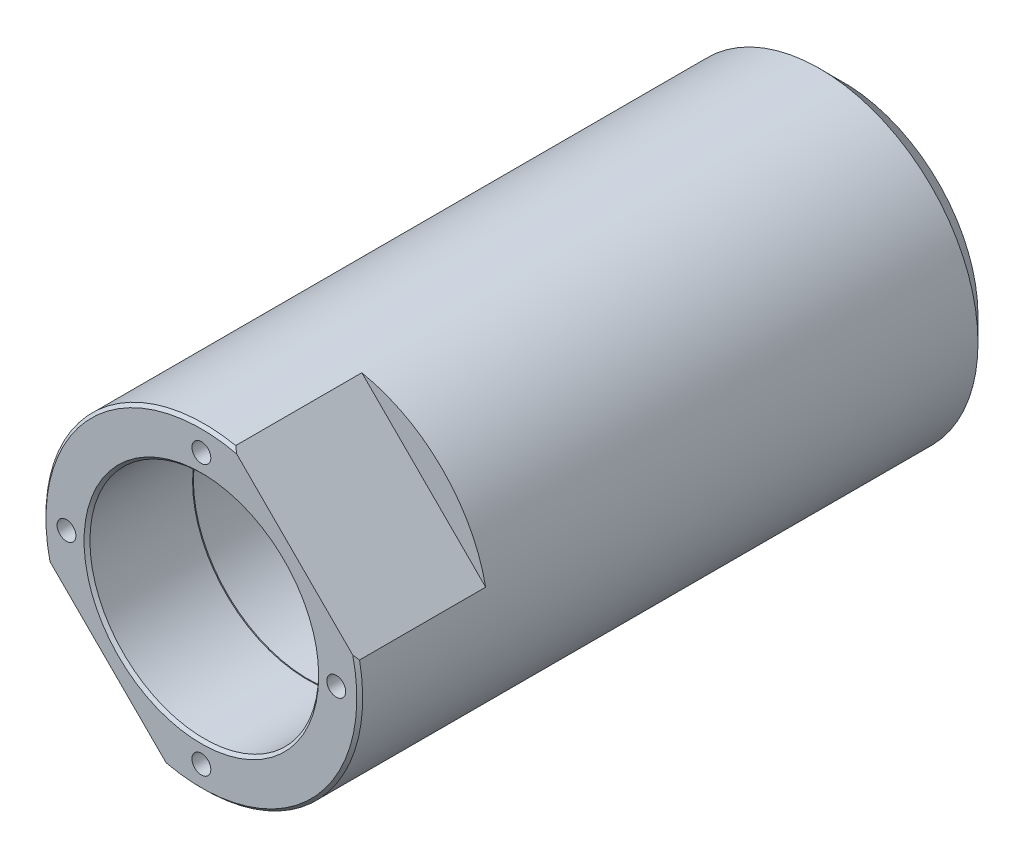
ISO-10303-21;
HEADER;
FILE_DESCRIPTION(('STEP AP214'),'2;1');
FILE_NAME('part.step','',(''),(''),'','','');
FILE_SCHEMA(('AUTOMOTIVE_DESIGN { 1 0 10303 214 1 1 1 1 }'));
ENDSEC;
DATA;
#1=APPLICATION_CONTEXT('core data for automotive mechanical design processes');
#2=APPLICATION_PROTOCOL_DEFINITION('international standard','automotive_design',2000,#1);
#3=PRODUCT_CONTEXT('',#1,'mechanical');
#4=PRODUCT('Part','Part','',(#3));
#5=PRODUCT_RELATED_PRODUCT_CATEGORY('part','',(#4));
#6=PRODUCT_DEFINITION_FORMATION('','',#4);
#7=PRODUCT_DEFINITION_CONTEXT('part definition',#1,'design');
#8=PRODUCT_DEFINITION('design','',#6,#7);
#9=PRODUCT_DEFINITION_SHAPE('','',#8);
#10=(LENGTH_UNIT() NAMED_UNIT(*) SI_UNIT(.MILLI.,.METRE.));
#11=(NAMED_UNIT(*) PLANE_ANGLE_UNIT() SI_UNIT($,.RADIAN.));
#12=(NAMED_UNIT(*) SI_UNIT($,.STERADIAN.) SOLID_ANGLE_UNIT());
#13=UNCERTAINTY_MEASURE_WITH_UNIT(LENGTH_MEASURE(1.E-05),#10,'distance_accuracy_value','');
#14=(GEOMETRIC_REPRESENTATION_CONTEXT(3) GLOBAL_UNCERTAINTY_ASSIGNED_CONTEXT((#13)) GLOBAL_UNIT_ASSIGNED_CONTEXT((#10,
#11,#12)) REPRESENTATION_CONTEXT('',''));
#15=CARTESIAN_POINT('',(0.,0.,0.));
#16=DIRECTION('',(0.,0.,1.));
#17=DIRECTION('',(1.,0.,0.));
#18=AXIS2_PLACEMENT_3D('',#15,#16,#17);
#19=CARTESIAN_POINT('',(0.,0.,0.));
#20=DIRECTION('',(0.,0.,-1.));
#21=DIRECTION('',(-1.,0.,0.));
#22=AXIS2_PLACEMENT_3D('',#19,#20,#21);
#23=CYLINDRICAL_SURFACE('',#22,42.8625);
#24=CARTESIAN_POINT('',(0.,0.,-167.3225));
#25=DIRECTION('',(0.,0.,-1.));
#26=DIRECTION('',(-1.,0.,0.));
#27=AXIS2_PLACEMENT_3D('',#24,#25,#26);
#28=CIRCLE('',#27,42.8625);
#29=CARTESIAN_POINT('',(42.8625,0.,-167.3225));
#30=VERTEX_POINT('',#29);
#31=EDGE_CURVE('E363',#30,#30,#28,.F.);
#32=ORIENTED_EDGE('',*,*,#31,.T.);
#33=EDGE_LOOP('',(#32));
#34=FACE_BOUND('',#33,.T.);
#35=CARTESIAN_POINT('',(0.,0.,-0.793750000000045));
#36=DIRECTION('',(0.,0.,1.));
#37=DIRECTION('',(1.,0.,0.));
#38=AXIS2_PLACEMENT_3D('',#35,#36,#37);
#39=CIRCLE('',#38,42.8625);
#40=CARTESIAN_POINT('',(-42.0105491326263,-8.50339154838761,-0.793750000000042));
#41=VERTEX_POINT('',#40);
#42=CARTESIAN_POINT('',(8.50339154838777,42.0105491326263,-0.793750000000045));
#43=VERTEX_POINT('',#42);
#44=EDGE_CURVE('E56',#41,#43,#39,.F.);
#45=ORIENTED_EDGE('',*,*,#44,.T.);
#46=DIRECTION('',(0.,0.,-1.));
#47=VECTOR('',#46,1.);
#48=CARTESIAN_POINT('',(8.50339154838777,42.0105491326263,0.));
#49=LINE('',#48,#47);
#50=CARTESIAN_POINT('',(8.50339154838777,42.0105491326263,-34.925));
#51=VERTEX_POINT('',#50);
#52=EDGE_CURVE('E338',#43,#51,#49,.T.);
#53=ORIENTED_EDGE('',*,*,#52,.T.);
#54=CARTESIAN_POINT('',(0.,0.,-34.925));
#55=DIRECTION('',(0.,0.,1.));
#56=DIRECTION('',(1.,0.,0.));
#57=AXIS2_PLACEMENT_3D('',#54,#55,#56);
#58=CIRCLE('',#57,42.8625);
#59=CARTESIAN_POINT('',(42.0105491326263,8.50339154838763,-34.925));
#60=VERTEX_POINT('',#59);
#61=EDGE_CURVE('E360',#51,#60,#58,.F.);
#62=ORIENTED_EDGE('',*,*,#61,.T.);
#63=DIRECTION('',(0.,0.,-1.));
#64=VECTOR('',#63,1.);
#65=CARTESIAN_POINT('',(42.0105491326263,8.50339154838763,0.));
#66=LINE('',#65,#64);
#67=CARTESIAN_POINT('',(42.0105491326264,8.50339154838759,-0.793750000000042));
#68=VERTEX_POINT('',#67);
#69=EDGE_CURVE('E335',#60,#68,#66,.F.);
#70=ORIENTED_EDGE('',*,*,#69,.T.);
#71=CARTESIAN_POINT('',(-8.50339154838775,-42.0105491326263,-0.793750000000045));
#72=VERTEX_POINT('',#71);
#73=EDGE_CURVE('E129',#68,#72,#39,.F.);
#74=ORIENTED_EDGE('',*,*,#73,.T.);
#75=DIRECTION('',(0.,0.,-1.));
#76=VECTOR('',#75,1.);
#77=CARTESIAN_POINT('',(-8.50339154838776,-42.0105491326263,0.));
#78=LINE('',#77,#76);
#79=CARTESIAN_POINT('',(-8.50339154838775,-42.0105491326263,-34.925));
#80=VERTEX_POINT('',#79);
#81=EDGE_CURVE('E64',#72,#80,#78,.T.);
#82=ORIENTED_EDGE('',*,*,#81,.T.);
#83=CARTESIAN_POINT('',(-42.0105491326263,-8.50339154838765,-34.925));
#84=VERTEX_POINT('',#83);
#85=EDGE_CURVE('E352',#80,#84,#58,.F.);
#86=ORIENTED_EDGE('',*,*,#85,.T.);
#87=DIRECTION('',(0.,0.,-1.));
#88=VECTOR('',#87,1.);
#89=CARTESIAN_POINT('',(-42.0105491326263,-8.50339154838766,0.));
#90=LINE('',#89,#88);
#91=EDGE_CURVE('E340',#84,#41,#90,.F.);
#92=ORIENTED_EDGE('',*,*,#91,.T.);
#93=EDGE_LOOP('',(#45,#53,#62,#70,#74,#82,#86,#92));
#94=FACE_BOUND('',#93,.T.);
#95=ADVANCED_FACE('F41',(#34,#94),#23,.T.);
#96=CARTESIAN_POINT('',(0.,42.8625,0.));
#97=DIRECTION('',(0.,0.,1.));
#98=DIRECTION('',(1.,0.,0.));
#99=AXIS2_PLACEMENT_3D('',#96,#97,#98);
#100=PLANE('',#99);
#101=CARTESIAN_POINT('',(0.,0.,0.));
#102=DIRECTION('',(0.,0.,1.));
#103=DIRECTION('',(1.,0.,0.));
#104=AXIS2_PLACEMENT_3D('',#101,#102,#103);
#105=CIRCLE('',#104,31.75);
#106=CARTESIAN_POINT('',(31.75,0.,0.));
#107=VERTEX_POINT('',#106);
#108=EDGE_CURVE('E49',#107,#107,#105,.F.);
#109=ORIENTED_EDGE('',*,*,#108,.T.);
#110=EDGE_LOOP('',(#109));
#111=FACE_BOUND('',#110,.T.);
#112=CARTESIAN_POINT('',(-36.5125,3.8244813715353E-13,0.));
#113=DIRECTION('',(0.,0.,1.));
#114=DIRECTION('',(1.,0.,0.));
#115=AXIS2_PLACEMENT_3D('',#112,#113,#114);
#116=CIRCLE('',#115,2.5527);
#117=CARTESIAN_POINT('',(-33.9598,3.8244813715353E-13,0.));
#118=VERTEX_POINT('',#117);
#119=EDGE_CURVE('E314',#118,#118,#116,.T.);
#120=ORIENTED_EDGE('',*,*,#119,.F.);
#121=EDGE_LOOP('',(#120));
#122=FACE_BOUND('',#121,.T.);
#123=CARTESIAN_POINT('',(0.,-36.5125,0.));
#124=DIRECTION('',(0.,0.,1.));
#125=DIRECTION('',(1.,0.,0.));
#126=AXIS2_PLACEMENT_3D('',#123,#124,#125);
#127=CIRCLE('',#126,2.5527);
#128=CARTESIAN_POINT('',(2.5527,-36.5125,0.));
#129=VERTEX_POINT('',#128);
#130=EDGE_CURVE('E308',#129,#129,#127,.T.);
#131=ORIENTED_EDGE('',*,*,#130,.F.);
#132=EDGE_LOOP('',(#131));
#133=FACE_BOUND('',#132,.T.);
#134=CARTESIAN_POINT('',(36.5125,-1.2748271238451E-13,0.));
#135=DIRECTION('',(0.,0.,1.));
#136=DIRECTION('',(1.,0.,0.));
#137=AXIS2_PLACEMENT_3D('',#134,#135,#136);
#138=CIRCLE('',#137,2.5527);
#139=CARTESIAN_POINT('',(39.0652,-1.2748271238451E-13,0.));
#140=VERTEX_POINT('',#139);
#141=EDGE_CURVE('E302',#140,#140,#138,.T.);
#142=ORIENTED_EDGE('',*,*,#141,.F.);
#143=EDGE_LOOP('',(#142));
#144=FACE_BOUND('',#143,.T.);
#145=CARTESIAN_POINT('',(0.,36.5125,0.));
#146=DIRECTION('',(0.,0.,1.));
#147=DIRECTION('',(1.,0.,0.));
#148=AXIS2_PLACEMENT_3D('',#145,#146,#147);
#149=CIRCLE('',#148,2.5527);
#150=CARTESIAN_POINT('',(2.5527,36.5125,0.));
#151=VERTEX_POINT('',#150);
#152=EDGE_CURVE('E290',#151,#151,#149,.T.);
#153=ORIENTED_EDGE('',*,*,#152,.F.);
#154=EDGE_LOOP('',(#153));
#155=FACE_BOUND('',#154,.T.);
#156=CARTESIAN_POINT('',(0.,0.,0.));
#157=DIRECTION('',(0.,0.,1.));
#158=DIRECTION('',(1.,0.,0.));
#159=AXIS2_PLACEMENT_3D('',#156,#157,#158);
#160=CIRCLE('',#159,42.0687499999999);
#161=CARTESIAN_POINT('',(-9.54152212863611,-40.9724185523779,0.));
#162=VERTEX_POINT('',#161);
#163=CARTESIAN_POINT('',(40.9724185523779,9.54152212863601,0.));
#164=VERTEX_POINT('',#163);
#165=EDGE_CURVE('E127',#162,#164,#160,.T.);
#166=ORIENTED_EDGE('',*,*,#165,.T.);
#167=DIRECTION('',(-0.707106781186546,0.707106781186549,0.));
#168=VECTOR('',#167,1.);
#169=CARTESIAN_POINT('',(-5.0513940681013,55.5653347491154,0.));
#170=LINE('',#169,#168);
#171=CARTESIAN_POINT('',(9.54152212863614,40.9724185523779,0.));
#172=VERTEX_POINT('',#171);
#173=EDGE_CURVE('E116',#164,#172,#170,.T.);
#174=ORIENTED_EDGE('',*,*,#173,.T.);
#175=CARTESIAN_POINT('',(-40.9724185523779,-9.54152212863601,0.));
#176=VERTEX_POINT('',#175);
#177=EDGE_CURVE('E122',#172,#176,#160,.T.);
#178=ORIENTED_EDGE('',*,*,#177,.T.);
#179=DIRECTION('',(0.707106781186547,-0.707106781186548,0.));
#180=VECTOR('',#179,1.);
#181=CARTESIAN_POINT('',(5.05139406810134,-55.5653347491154,0.));
#182=LINE('',#181,#180);
#183=EDGE_CURVE('E107',#176,#162,#182,.T.);
#184=ORIENTED_EDGE('',*,*,#183,.T.);
#185=EDGE_LOOP('',(#166,#174,#178,#184));
#186=FACE_BOUND('',#185,.T.);
#187=ADVANCED_FACE('F126',(#111,#122,#133,#144,#155,#186),#100,.T.);
#188=CARTESIAN_POINT('',(0.,0.,-0.793750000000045));
#189=DIRECTION('',(0.,0.,-1.));
#190=DIRECTION('',(-1.,0.,0.));
#191=AXIS2_PLACEMENT_3D('',#188,#189,#190);
#192=CONICAL_SURFACE('',#191,42.8625,0.785398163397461);
#193=ORIENTED_EDGE('',*,*,#73,.F.);
#194=CARTESIAN_POINT('',(78.6426335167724,-28.1286928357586,-41.4530266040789));
#195=CARTESIAN_POINT('',(77.8638607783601,-27.3499200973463,-40.4575027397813));
#196=CARTESIAN_POINT('',(77.0837062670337,-26.5697655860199,-39.4641346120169));
#197=CARTESIAN_POINT('',(75.5202379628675,-25.0062972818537,-37.482362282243));
#198=CARTESIAN_POINT('',(74.7369241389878,-24.2229834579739,-36.4939581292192));
#199=CARTESIAN_POINT('',(73.1665288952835,-22.6525882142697,-34.522499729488));
#200=CARTESIAN_POINT('',(72.3794464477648,-21.865505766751,-33.5394471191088));
#201=CARTESIAN_POINT('',(70.8012690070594,-20.2873283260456,-31.5798071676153));
#202=CARTESIAN_POINT('',(70.0101740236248,-19.4962333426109,-30.6032198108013));
#203=CARTESIAN_POINT('',(68.4159277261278,-17.901987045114,-28.6483052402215));
#204=CARTESIAN_POINT('',(67.6127330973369,-17.0987924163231,-27.6700486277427));
#205=CARTESIAN_POINT('',(66.0010179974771,-15.4870773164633,-25.7223513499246));
#206=CARTESIAN_POINT('',(65.1924975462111,-14.6785568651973,-24.7529106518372));
#207=CARTESIAN_POINT('',(63.5694415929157,-13.0555009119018,-22.8244895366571));
#208=CARTESIAN_POINT('',(62.7549069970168,-12.240966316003,-21.8655075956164));
#209=CARTESIAN_POINT('',(61.1187403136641,-10.6047996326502,-19.9597230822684));
#210=CARTESIAN_POINT('',(60.2971082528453,-9.78316757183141,-19.0129204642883));
#211=CARTESIAN_POINT('',(58.7357557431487,-8.22181506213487,-17.2364407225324));
#212=CARTESIAN_POINT('',(57.9968889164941,-7.48294823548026,-16.4052644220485));
#213=CARTESIAN_POINT('',(56.5115972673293,-5.99765658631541,-14.756498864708));
#214=CARTESIAN_POINT('',(55.7651724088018,-5.25123172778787,-13.9389096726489));
#215=CARTESIAN_POINT('',(54.2632805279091,-3.74933984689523,-12.3195628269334));
#216=CARTESIAN_POINT('',(53.5078098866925,-2.9938692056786,-11.5178118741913));
#217=CARTESIAN_POINT('',(51.986737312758,-1.4727966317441,-9.93375286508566));
#218=CARTESIAN_POINT('',(51.2211355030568,-0.707194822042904,-9.151444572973));
#219=CARTESIAN_POINT('',(49.6798358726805,0.834104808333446,-7.61210660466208));
#220=CARTESIAN_POINT('',(48.9041641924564,1.60977648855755,-6.85502473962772));
#221=CARTESIAN_POINT('',(47.3390821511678,3.17485852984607,-5.36957983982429));
#222=CARTESIAN_POINT('',(46.549670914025,3.96426976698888,-4.64121864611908));
#223=CARTESIAN_POINT('',(44.9554406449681,5.55850003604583,-3.2205671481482));
#224=CARTESIAN_POINT('',(44.1506327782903,6.36330790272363,-2.52825196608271));
#225=CARTESIAN_POINT('',(42.9297304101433,7.58421027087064,-1.52326382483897));
#226=CARTESIAN_POINT('',(42.520504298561,7.99343638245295,-1.19386591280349));
#227=CARTESIAN_POINT('',(41.6971435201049,8.81679716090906,-0.547596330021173));
#228=CARTESIAN_POINT('',(41.2830090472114,9.23093163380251,-0.230724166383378));
#229=CARTESIAN_POINT('',(40.4721637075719,10.0417769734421,0.372124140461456));
#230=CARTESIAN_POINT('',(40.0757294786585,10.4382112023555,0.658843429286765));
#231=CARTESIAN_POINT('',(39.2779378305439,11.23600285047,1.21824038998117));
#232=CARTESIAN_POINT('',(38.8765804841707,11.6373601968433,1.4909182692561));
#233=CARTESIAN_POINT('',(38.0686580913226,12.4452825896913,2.02063415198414));
#234=CARTESIAN_POINT('',(37.6620924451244,12.8518482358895,2.27767033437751));
#235=CARTESIAN_POINT('',(36.843676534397,13.6702641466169,2.77423011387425));
#236=CARTESIAN_POINT('',(36.4318262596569,14.0821144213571,3.01375367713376));
#237=CARTESIAN_POINT('',(35.1898327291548,15.3241079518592,3.70217374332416));
#238=CARTESIAN_POINT('',(34.351410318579,16.162530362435,4.1221419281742));
#239=CARTESIAN_POINT('',(33.0783771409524,17.4355635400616,4.68088534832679));
#240=CARTESIAN_POINT('',(32.651469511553,17.862471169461,4.85526394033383));
#241=CARTESIAN_POINT('',(31.7927530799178,18.7211876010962,5.17810719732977));
#242=CARTESIAN_POINT('',(31.3609445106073,19.1529961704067,5.32657308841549));
#243=CARTESIAN_POINT('',(30.564167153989,19.949773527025,5.57339263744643));
#244=CARTESIAN_POINT('',(30.1998509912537,20.3140896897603,5.67597157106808));
#245=CARTESIAN_POINT('',(29.4686066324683,21.0453340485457,5.86037990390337));
#246=CARTESIAN_POINT('',(29.1016785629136,21.4122621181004,5.94221030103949));
#247=CARTESIAN_POINT('',(28.3657618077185,22.1481788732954,6.08413437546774));
#248=CARTESIAN_POINT('',(27.9967733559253,22.5171673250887,6.14423047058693));
#249=CARTESIAN_POINT('',(27.2573028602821,23.2566378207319,6.24193382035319));
#250=CARTESIAN_POINT('',(26.8868208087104,23.6271198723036,6.27954095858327));
#251=CARTESIAN_POINT('',(26.14567721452,24.368263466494,6.33172142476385));
#252=CARTESIAN_POINT('',(25.7750170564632,24.7389236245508,6.34633394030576));
#253=CARTESIAN_POINT('',(25.0336050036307,25.4803356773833,6.35245050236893));
#254=CARTESIAN_POINT('',(24.6628531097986,25.8510875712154,6.34395477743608));
#255=CARTESIAN_POINT('',(23.9219293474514,26.5920113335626,6.30396759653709));
#256=CARTESIAN_POINT('',(23.5517575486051,26.9621831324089,6.27247356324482));
#257=CARTESIAN_POINT('',(22.812717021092,27.701223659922,6.18690882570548));
#258=CARTESIAN_POINT('',(22.4438483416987,28.0700923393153,6.13283727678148));
#259=CARTESIAN_POINT('',(21.6253894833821,28.8885511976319,5.98819657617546));
#260=CARTESIAN_POINT('',(21.176279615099,29.337661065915,5.892157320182));
#261=CARTESIAN_POINT('',(20.2819413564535,30.2319993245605,5.66897927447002));
#262=CARTESIAN_POINT('',(19.8367132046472,30.6772274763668,5.54183858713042));
#263=CARTESIAN_POINT('',(18.9507877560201,31.5631529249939,5.25852768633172));
#264=CARTESIAN_POINT('',(18.5100917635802,32.0038489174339,5.10234934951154));
#265=CARTESIAN_POINT('',(17.6338913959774,32.8800492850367,4.76330023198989));
#266=CARTESIAN_POINT('',(17.1983869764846,33.3155537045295,4.58042967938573));
#267=CARTESIAN_POINT('',(16.3305632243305,34.1833774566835,4.18933054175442));
#268=CARTESIAN_POINT('',(15.8982733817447,34.6156672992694,3.98097157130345));
#269=CARTESIAN_POINT('',(15.0393833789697,35.4745573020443,3.54205074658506));
#270=CARTESIAN_POINT('',(14.612783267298,35.901157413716,3.31148870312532));
#271=CARTESIAN_POINT('',(13.7653790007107,36.7485616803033,2.83048720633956));
#272=CARTESIAN_POINT('',(13.3445732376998,37.1693674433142,2.58005340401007));
#273=CARTESIAN_POINT('',(12.5085346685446,38.0054060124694,2.06134761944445));
#274=CARTESIAN_POINT('',(12.0933016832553,38.4206389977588,1.79307621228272));
#275=CARTESIAN_POINT('',(10.8705940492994,39.6433466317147,0.974404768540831));
#276=CARTESIAN_POINT('',(10.070713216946,40.443227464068,0.401244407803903));
#277=CARTESIAN_POINT('',(8.48944080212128,42.0244998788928,-0.794244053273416));
#278=CARTESIAN_POINT('',(7.7080546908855,42.8058859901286,-1.4165864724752));
#279=CARTESIAN_POINT('',(6.16087983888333,44.3530608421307,-2.70139130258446));
#280=CARTESIAN_POINT('',(5.39510895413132,45.1188317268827,-3.36389654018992));
#281=CARTESIAN_POINT('',(3.87798653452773,46.6359541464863,-4.72078642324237));
#282=CARTESIAN_POINT('',(3.1266336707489,47.3873070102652,-5.4151681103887));
#283=CARTESIAN_POINT('',(1.63344333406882,48.8804973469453,-6.83274821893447));
#284=CARTESIAN_POINT('',(0.891654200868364,49.6222864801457,-7.55604816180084));
#285=CARTESIAN_POINT('',(-0.581130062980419,51.0950707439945,-9.02428775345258));
#286=CARTESIAN_POINT('',(-1.31212499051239,51.8260656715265,-9.76922780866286));
#287=CARTESIAN_POINT('',(-2.76436012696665,53.2783008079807,-11.2766624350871));
#288=CARTESIAN_POINT('',(-3.48560556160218,53.9995462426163,-12.0391469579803));
#289=CARTESIAN_POINT('',(-4.91999102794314,55.4339317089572,-13.5791736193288));
#290=CARTESIAN_POINT('',(-5.63313112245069,56.1470718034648,-14.3567156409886));
#291=CARTESIAN_POINT('',(-7.05670092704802,57.5706416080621,-15.9293403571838));
#292=CARTESIAN_POINT('',(-7.7670873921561,58.2810280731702,-16.7245012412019));
#293=CARTESIAN_POINT('',(-9.18162990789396,59.6955705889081,-18.3258204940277));
#294=CARTESIAN_POINT('',(-9.88578595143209,60.3997266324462,-19.1319788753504));
#295=CARTESIAN_POINT('',(-11.2887097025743,61.8026503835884,-20.753826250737));
#296=CARTESIAN_POINT('',(-11.9874768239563,62.5014175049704,-21.5695162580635));
#297=CARTESIAN_POINT('',(-13.3801986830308,63.8941393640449,-23.209064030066));
#298=CARTESIAN_POINT('',(-14.0741534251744,64.5880941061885,-24.0329217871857));
#299=CARTESIAN_POINT('',(-15.4564744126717,65.9704150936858,-25.6861518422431));
#300=CARTESIAN_POINT('',(-16.1448488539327,66.6587895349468,-26.5155104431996));
#301=CARTESIAN_POINT('',(-17.5178372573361,68.0317779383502,-28.180434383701));
#302=CARTESIAN_POINT('',(-18.2024512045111,68.7163918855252,-29.0159997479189));
#303=CARTESIAN_POINT('',(-19.5682956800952,70.0822363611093,-30.6925586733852));
#304=CARTESIAN_POINT('',(-20.2495263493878,70.763467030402,-31.5335520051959));
#305=CARTESIAN_POINT('',(-21.6089872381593,72.1229279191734,-33.2203749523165));
#306=CARTESIAN_POINT('',(-22.2872174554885,72.8011581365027,-34.0662045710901));
#307=CARTESIAN_POINT('',(-23.3973767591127,73.9113174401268,-35.456983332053));
#308=CARTESIAN_POINT('',(-23.8301016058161,74.3440422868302,-36.0006630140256));
#309=CARTESIAN_POINT('',(-24.6946024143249,75.208543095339,-37.0897692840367));
#310=CARTESIAN_POINT('',(-25.1263781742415,75.6403188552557,-37.6351961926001));
#311=CARTESIAN_POINT('',(-25.9871360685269,76.5010767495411,-38.7252651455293));
#312=CARTESIAN_POINT('',(-26.4161222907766,76.9300629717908,-39.2699007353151));
#313=CARTESIAN_POINT('',(-27.2731101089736,77.7870507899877,-40.3604806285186));
#314=CARTESIAN_POINT('',(-27.7011118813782,78.2150525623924,-40.906424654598));
#315=CARTESIAN_POINT('',(-28.1286928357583,78.6426335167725,-41.4530266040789));
#316=B_SPLINE_CURVE_WITH_KNOTS('',3,(#194,#195,#196,#197,#198,#199,#200,#201,#202,#203,#204,
#205,#206,#207,#208,#209,#210,#211,#212,#213,#214,#215,#216,#217,#218,#219,#220,#221,#222,#223,
#224,#225,#226,#227,#228,#229,#230,#231,#232,#233,#234,#235,#236,#237,#238,#239,#240,#241,#242,
#243,#244,#245,#246,#247,#248,#249,#250,#251,#252,#253,#254,#255,#256,#257,#258,#259,#260,#261,
#262,#263,#264,#265,#266,#267,#268,#269,#270,#271,#272,#273,#274,#275,#276,#277,#278,#279,#280,
#281,#282,#283,#284,#285,#286,#287,#288,#289,#290,#291,#292,#293,#294,#295,#296,#297,#298,#299,
#300,#301,#302,#303,#304,#305,#306,#307,#308,#309,#310,#311,#312,#313,#314,#315),.UNSPECIFIED.,
.F.,.F.,(4,2,2,2,2,2,2,2,2,2,2,2,2,2,2,2,2,2,2,2,2,2,2,2,2,2,2,2,2,2,2,2,2,2,2,2,2,2,2,2,2,2,2,
2,2,2,2,2,2,2,2,2,2,2,2,2,2,2,2,2,4),(0.,4.45380784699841,8.90765955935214,13.3628041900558,
17.8179379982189,22.3151278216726,26.8123009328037,31.3088097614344,35.8053017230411,
39.8107443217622,43.8162060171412,47.8233275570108,51.8304004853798,55.8285913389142,
59.8270380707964,63.8226875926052,65.8202904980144,67.8178147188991,69.7067525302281,
71.595662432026,73.4847918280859,75.3739248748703,79.1435936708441,81.0283989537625,
82.913115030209,84.4887269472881,86.0642630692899,87.639623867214,89.2149928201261,
90.7876740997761,92.3603398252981,93.9331818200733,95.5060826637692,97.4323073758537,
99.3586496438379,101.285531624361,103.212397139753,105.149567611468,107.086754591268,
109.023392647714,110.959968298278,114.762645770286,118.56643446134,122.374353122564,
126.181919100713,130.004285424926,133.826723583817,137.647024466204,141.467295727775,
145.310929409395,149.15456746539,152.998617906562,156.842664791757,160.679299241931,
164.515948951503,168.352437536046,172.188928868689,174.644695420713,177.100941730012,
179.546788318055,181.99215566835),.UNSPECIFIED.);
#317=EDGE_CURVE('E357',#68,#164,#316,.T.);
#318=ORIENTED_EDGE('',*,*,#317,.T.);
#319=ORIENTED_EDGE('',*,*,#165,.F.);
#320=CARTESIAN_POINT('',(-78.6426335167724,28.1286928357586,-41.4530266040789));
#321=CARTESIAN_POINT('',(-77.8638607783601,27.3499200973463,-40.4575027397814));
#322=CARTESIAN_POINT('',(-77.0837062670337,26.5697655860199,-39.4641346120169));
#323=CARTESIAN_POINT('',(-75.5202379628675,25.0062972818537,-37.482362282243));
#324=CARTESIAN_POINT('',(-74.7369241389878,24.2229834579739,-36.4939581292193));
#325=CARTESIAN_POINT('',(-73.1665288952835,22.6525882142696,-34.522499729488));
#326=CARTESIAN_POINT('',(-72.3794464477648,21.865505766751,-33.5394471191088));
#327=CARTESIAN_POINT('',(-70.8012690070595,20.2873283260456,-31.5798071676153));
#328=CARTESIAN_POINT('',(-70.0101740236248,19.4962333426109,-30.6032198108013));
#329=CARTESIAN_POINT('',(-68.4159277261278,17.9019870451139,-28.6483052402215));
#330=CARTESIAN_POINT('',(-67.6127330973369,17.098792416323,-27.6700486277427));
#331=CARTESIAN_POINT('',(-66.0010179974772,15.4870773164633,-25.7223513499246));
#332=CARTESIAN_POINT('',(-65.1924975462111,14.6785568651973,-24.7529106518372));
#333=CARTESIAN_POINT('',(-63.5694415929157,13.0555009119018,-22.8244895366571));
#334=CARTESIAN_POINT('',(-62.7549069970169,12.240966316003,-21.8655075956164));
#335=CARTESIAN_POINT('',(-61.1187403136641,10.6047996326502,-19.9597230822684));
#336=CARTESIAN_POINT('',(-60.2971082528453,9.78316757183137,-19.0129204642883));
#337=CARTESIAN_POINT('',(-58.7357557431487,8.22181506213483,-17.2364407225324));
#338=CARTESIAN_POINT('',(-57.9968889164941,7.48294823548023,-16.4052644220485));
#339=CARTESIAN_POINT('',(-56.5115972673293,5.99765658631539,-14.756498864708));
#340=CARTESIAN_POINT('',(-55.7651724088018,5.25123172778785,-13.9389096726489));
#341=CARTESIAN_POINT('',(-54.2632805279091,3.74933984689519,-12.3195628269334));
#342=CARTESIAN_POINT('',(-53.5078098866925,2.99386920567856,-11.5178118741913));
#343=CARTESIAN_POINT('',(-51.986737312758,1.47279663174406,-9.93375286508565));
#344=CARTESIAN_POINT('',(-51.2211355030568,0.707194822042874,-9.15144457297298));
#345=CARTESIAN_POINT('',(-49.6798358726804,-0.834104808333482,-7.61210660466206));
#346=CARTESIAN_POINT('',(-48.9041641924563,-1.6097764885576,-6.8550247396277));
#347=CARTESIAN_POINT('',(-47.3390821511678,-3.17485852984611,-5.36957983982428));
#348=CARTESIAN_POINT('',(-46.549670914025,-3.96426976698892,-4.64121864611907));
#349=CARTESIAN_POINT('',(-44.9554406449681,-5.55850003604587,-3.22056714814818));
#350=CARTESIAN_POINT('',(-44.1506327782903,-6.36330790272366,-2.52825196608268));
#351=CARTESIAN_POINT('',(-42.9297304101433,-7.58421027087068,-1.52326382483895));
#352=CARTESIAN_POINT('',(-42.520504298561,-7.993436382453,-1.19386591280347));
#353=CARTESIAN_POINT('',(-41.6971435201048,-8.81679716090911,-0.547596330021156));
#354=CARTESIAN_POINT('',(-41.2830090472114,-9.23093163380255,-0.230724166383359));
#355=CARTESIAN_POINT('',(-40.4721637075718,-10.0417769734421,0.372124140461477));
#356=CARTESIAN_POINT('',(-40.0757294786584,-10.4382112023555,0.658843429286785));
#357=CARTESIAN_POINT('',(-39.2779378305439,-11.2360028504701,1.21824038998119));
#358=CARTESIAN_POINT('',(-38.8765804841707,-11.6373601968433,1.49091826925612));
#359=CARTESIAN_POINT('',(-38.0686580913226,-12.4452825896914,2.02063415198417));
#360=CARTESIAN_POINT('',(-37.6620924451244,-12.8518482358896,2.27767033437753));
#361=CARTESIAN_POINT('',(-36.843676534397,-13.670264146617,2.77423011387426));
#362=CARTESIAN_POINT('',(-36.4318262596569,-14.0821144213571,3.01375367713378));
#363=CARTESIAN_POINT('',(-35.1898327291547,-15.3241079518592,3.70217374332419));
#364=CARTESIAN_POINT('',(-34.351410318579,-16.162530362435,4.12214192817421));
#365=CARTESIAN_POINT('',(-33.0783771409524,-17.4355635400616,4.6808853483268));
#366=CARTESIAN_POINT('',(-32.6514695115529,-17.862471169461,4.85526394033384));
#367=CARTESIAN_POINT('',(-31.7927530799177,-18.7211876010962,5.17810719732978));
#368=CARTESIAN_POINT('',(-31.3609445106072,-19.1529961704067,5.3265730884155));
#369=CARTESIAN_POINT('',(-30.5641671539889,-19.949773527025,5.57339263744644));
#370=CARTESIAN_POINT('',(-30.1998509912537,-20.3140896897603,5.6759715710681));
#371=CARTESIAN_POINT('',(-29.4686066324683,-21.0453340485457,5.86037990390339));
#372=CARTESIAN_POINT('',(-29.1016785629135,-21.4122621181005,5.9422103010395));
#373=CARTESIAN_POINT('',(-28.3657618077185,-22.1481788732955,6.08413437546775));
#374=CARTESIAN_POINT('',(-27.9967733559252,-22.5171673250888,6.14423047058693));
#375=CARTESIAN_POINT('',(-27.2573028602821,-23.2566378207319,6.24193382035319));
#376=CARTESIAN_POINT('',(-26.8868208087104,-23.6271198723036,6.27954095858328));
#377=CARTESIAN_POINT('',(-26.1456772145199,-24.368263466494,6.33172142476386));
#378=CARTESIAN_POINT('',(-25.7750170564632,-24.7389236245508,6.34633394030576));
#379=CARTESIAN_POINT('',(-25.0336050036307,-25.4803356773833,6.35245050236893));
#380=CARTESIAN_POINT('',(-24.6628531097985,-25.8510875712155,6.34395477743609));
#381=CARTESIAN_POINT('',(-23.9219293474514,-26.5920113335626,6.3039675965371));
#382=CARTESIAN_POINT('',(-23.5517575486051,-26.9621831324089,6.27247356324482));
#383=CARTESIAN_POINT('',(-22.812717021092,-27.701223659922,6.18690882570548));
#384=CARTESIAN_POINT('',(-22.4438483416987,-28.0700923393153,6.13283727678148));
#385=CARTESIAN_POINT('',(-21.6253894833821,-28.8885511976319,5.98819657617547));
#386=CARTESIAN_POINT('',(-21.176279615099,-29.337661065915,5.892157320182));
#387=CARTESIAN_POINT('',(-20.2819413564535,-30.2319993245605,5.66897927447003));
#388=CARTESIAN_POINT('',(-19.8367132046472,-30.6772274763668,5.54183858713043));
#389=CARTESIAN_POINT('',(-18.9507877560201,-31.5631529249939,5.25852768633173));
#390=CARTESIAN_POINT('',(-18.5100917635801,-32.0038489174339,5.10234934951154));
#391=CARTESIAN_POINT('',(-17.6338913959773,-32.8800492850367,4.76330023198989));
#392=CARTESIAN_POINT('',(-17.1983869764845,-33.3155537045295,4.58042967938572));
#393=CARTESIAN_POINT('',(-16.3305632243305,-34.1833774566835,4.18933054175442));
#394=CARTESIAN_POINT('',(-15.8982733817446,-34.6156672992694,3.98097157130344));
#395=CARTESIAN_POINT('',(-15.0393833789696,-35.4745573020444,3.54205074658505));
#396=CARTESIAN_POINT('',(-14.612783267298,-35.9011574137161,3.31148870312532));
#397=CARTESIAN_POINT('',(-13.7653790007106,-36.7485616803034,2.83048720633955));
#398=CARTESIAN_POINT('',(-13.3445732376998,-37.1693674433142,2.58005340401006));
#399=CARTESIAN_POINT('',(-12.5085346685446,-38.0054060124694,2.06134761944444));
#400=CARTESIAN_POINT('',(-12.0933016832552,-38.4206389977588,1.79307621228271));
#401=CARTESIAN_POINT('',(-10.8705940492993,-39.6433466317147,0.974404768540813));
#402=CARTESIAN_POINT('',(-10.070713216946,-40.443227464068,0.401244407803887));
#403=CARTESIAN_POINT('',(-8.48944080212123,-42.0244998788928,-0.794244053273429));
#404=CARTESIAN_POINT('',(-7.70805469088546,-42.8058859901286,-1.41658647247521));
#405=CARTESIAN_POINT('',(-6.16087983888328,-44.3530608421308,-2.70139130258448));
#406=CARTESIAN_POINT('',(-5.39510895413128,-45.1188317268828,-3.36389654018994));
#407=CARTESIAN_POINT('',(-3.87798653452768,-46.6359541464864,-4.72078642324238));
#408=CARTESIAN_POINT('',(-3.12663367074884,-47.3873070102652,-5.41516811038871));
#409=CARTESIAN_POINT('',(-1.63344333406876,-48.8804973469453,-6.83274821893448));
#410=CARTESIAN_POINT('',(-0.891654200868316,-49.6222864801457,-7.55604816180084));
#411=CARTESIAN_POINT('',(0.581130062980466,-51.0950707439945,-9.02428775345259));
#412=CARTESIAN_POINT('',(1.31212499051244,-51.8260656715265,-9.76922780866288));
#413=CARTESIAN_POINT('',(2.76436012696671,-53.2783008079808,-11.2766624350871));
#414=CARTESIAN_POINT('',(3.48560556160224,-53.9995462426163,-12.0391469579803));
#415=CARTESIAN_POINT('',(4.91999102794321,-55.4339317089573,-13.5791736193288));
#416=CARTESIAN_POINT('',(5.63313112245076,-56.1470718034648,-14.3567156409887));
#417=CARTESIAN_POINT('',(7.05670092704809,-57.5706416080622,-15.9293403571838));
#418=CARTESIAN_POINT('',(7.76708739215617,-58.2810280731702,-16.7245012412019));
#419=CARTESIAN_POINT('',(9.18162990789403,-59.6955705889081,-18.3258204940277));
#420=CARTESIAN_POINT('',(9.88578595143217,-60.3997266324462,-19.1319788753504));
#421=CARTESIAN_POINT('',(11.2887097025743,-61.8026503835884,-20.753826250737));
#422=CARTESIAN_POINT('',(11.9874768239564,-62.5014175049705,-21.5695162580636));
#423=CARTESIAN_POINT('',(13.3801986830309,-63.894139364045,-23.2090640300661));
#424=CARTESIAN_POINT('',(14.0741534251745,-64.5880941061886,-24.0329217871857));
#425=CARTESIAN_POINT('',(15.4564744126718,-65.9704150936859,-25.6861518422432));
#426=CARTESIAN_POINT('',(16.1448488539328,-66.6587895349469,-26.5155104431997));
#427=CARTESIAN_POINT('',(17.5178372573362,-68.0317779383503,-28.1804343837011));
#428=CARTESIAN_POINT('',(18.2024512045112,-68.7163918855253,-29.015999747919));
#429=CARTESIAN_POINT('',(19.5682956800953,-70.0822363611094,-30.6925586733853));
#430=CARTESIAN_POINT('',(20.2495263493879,-70.763467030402,-31.533552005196));
#431=CARTESIAN_POINT('',(21.6089872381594,-72.1229279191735,-33.2203749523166));
#432=CARTESIAN_POINT('',(22.2872174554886,-72.8011581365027,-34.0662045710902));
#433=CARTESIAN_POINT('',(23.3973767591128,-73.9113174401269,-35.4569833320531));
#434=CARTESIAN_POINT('',(23.8301016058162,-74.3440422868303,-36.0006630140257));
#435=CARTESIAN_POINT('',(24.694602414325,-75.2085430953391,-37.0897692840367));
#436=CARTESIAN_POINT('',(25.1263781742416,-75.6403188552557,-37.6351961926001));
#437=CARTESIAN_POINT('',(25.987136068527,-76.5010767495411,-38.7252651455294));
#438=CARTESIAN_POINT('',(26.4161222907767,-76.9300629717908,-39.2699007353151));
#439=CARTESIAN_POINT('',(27.2731101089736,-77.7870507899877,-40.3604806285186));
#440=CARTESIAN_POINT('',(27.7011118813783,-78.2150525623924,-40.906424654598));
#441=CARTESIAN_POINT('',(28.1286928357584,-78.6426335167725,-41.4530266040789));
#442=B_SPLINE_CURVE_WITH_KNOTS('',3,(#320,#321,#322,#323,#324,#325,#326,#327,#328,#329,#330,
#331,#332,#333,#334,#335,#336,#337,#338,#339,#340,#341,#342,#343,#344,#345,#346,#347,#348,#349,
#350,#351,#352,#353,#354,#355,#356,#357,#358,#359,#360,#361,#362,#363,#364,#365,#366,#367,#368,
#369,#370,#371,#372,#373,#374,#375,#376,#377,#378,#379,#380,#381,#382,#383,#384,#385,#386,#387,
#388,#389,#390,#391,#392,#393,#394,#395,#396,#397,#398,#399,#400,#401,#402,#403,#404,#405,#406,
#407,#408,#409,#410,#411,#412,#413,#414,#415,#416,#417,#418,#419,#420,#421,#422,#423,#424,#425,
#426,#427,#428,#429,#430,#431,#432,#433,#434,#435,#436,#437,#438,#439,#440,#441),.UNSPECIFIED.,
.F.,.F.,(4,2,2,2,2,2,2,2,2,2,2,2,2,2,2,2,2,2,2,2,2,2,2,2,2,2,2,2,2,2,2,2,2,2,2,2,2,2,2,2,2,2,2,
2,2,2,2,2,2,2,2,2,2,2,2,2,2,2,2,2,4),(0.,4.45380784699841,8.90765955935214,13.3628041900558,
17.8179379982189,22.3151278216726,26.8123009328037,31.3088097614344,35.8053017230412,
39.8107443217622,43.8162060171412,47.8233275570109,51.8304004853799,55.8285913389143,
59.8270380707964,63.8226875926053,65.8202904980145,67.8178147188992,69.7067525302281,
71.595662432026,73.484791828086,75.3739248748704,79.1435936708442,81.0283989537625,
82.9131150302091,84.4887269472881,86.0642630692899,87.6396238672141,89.2149928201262,
90.7876740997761,92.3603398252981,93.9331818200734,95.5060826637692,97.4323073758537,
99.3586496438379,101.285531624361,103.212397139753,105.149567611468,107.086754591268,
109.023392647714,110.959968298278,114.762645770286,118.56643446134,122.374353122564,
126.181919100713,130.004285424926,133.826723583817,137.647024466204,141.467295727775,
145.310929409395,149.15456746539,152.998617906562,156.842664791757,160.679299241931,
164.515948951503,168.352437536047,172.18892886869,174.644695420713,177.100941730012,
179.546788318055,181.99215566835),.UNSPECIFIED.);
#443=EDGE_CURVE('E111',#162,#72,#442,.T.);
#444=ORIENTED_EDGE('',*,*,#443,.T.);
#445=EDGE_LOOP('',(#193,#318,#319,#444));
#446=FACE_BOUND('',#445,.T.);
#447=ADVANCED_FACE('F143',(#446),#192,.T.);
#448=ORIENTED_EDGE('',*,*,#177,.F.);
#449=EDGE_CURVE('E123',#172,#43,#316,.T.);
#450=ORIENTED_EDGE('',*,*,#449,.T.);
#451=ORIENTED_EDGE('',*,*,#44,.F.);
#452=EDGE_CURVE('E110',#41,#176,#442,.T.);
#453=ORIENTED_EDGE('',*,*,#452,.T.);
#454=EDGE_LOOP('',(#448,#450,#451,#453));
#455=FACE_BOUND('',#454,.T.);
#456=ADVANCED_FACE('F120',(#455),#192,.T.);
#457=CARTESIAN_POINT('',(0.,0.,0.));
#458=DIRECTION('',(0.,0.,-1.));
#459=DIRECTION('',(-1.,0.,0.));
#460=AXIS2_PLACEMENT_3D('',#457,#458,#459);
#461=CYLINDRICAL_SURFACE('',#460,30.95625);
#462=CARTESIAN_POINT('',(0.,0.,-0.793750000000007));
#463=DIRECTION('',(0.,0.,1.));
#464=DIRECTION('',(1.,0.,0.));
#465=AXIS2_PLACEMENT_3D('',#462,#463,#464);
#466=CIRCLE('',#465,30.95625);
#467=CARTESIAN_POINT('',(30.95625,0.,-0.793750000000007));
#468=VERTEX_POINT('',#467);
#469=EDGE_CURVE('E13',#468,#468,#466,.T.);
#470=ORIENTED_EDGE('',*,*,#469,.T.);
#471=EDGE_LOOP('',(#470));
#472=FACE_BOUND('',#471,.T.);
#473=CARTESIAN_POINT('',(0.,0.,-28.575));
#474=DIRECTION('',(0.,0.,-1.));
#475=DIRECTION('',(-1.,0.,0.));
#476=AXIS2_PLACEMENT_3D('',#473,#474,#475);
#477=CIRCLE('',#476,30.95625);
#478=CARTESIAN_POINT('',(-30.95625,0.,-28.575));
#479=VERTEX_POINT('',#478);
#480=EDGE_CURVE('E261',#479,#479,#477,.T.);
#481=ORIENTED_EDGE('',*,*,#480,.T.);
#482=EDGE_LOOP('',(#481));
#483=FACE_BOUND('',#482,.T.);
#484=ADVANCED_FACE('F240',(#472,#483),#461,.F.);
#485=CARTESIAN_POINT('',(0.,0.,-28.575));
#486=DIRECTION('',(0.,0.,-1.));
#487=DIRECTION('',(-1.,0.,0.));
#488=AXIS2_PLACEMENT_3D('',#485,#486,#487);
#489=CONICAL_SURFACE('',#488,30.95625,0.349065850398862);
#490=CARTESIAN_POINT('',(0.,0.,-28.9239296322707));
#491=DIRECTION('',(0.,0.,-1.));
#492=DIRECTION('',(-1.,0.,0.));
#493=AXIS2_PLACEMENT_3D('',#490,#491,#492);
#494=CIRCLE('',#493,31.08325);
#495=CARTESIAN_POINT('',(-31.08325,0.,-28.9239296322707));
#496=VERTEX_POINT('',#495);
#497=EDGE_CURVE('E264',#496,#496,#494,.T.);
#498=ORIENTED_EDGE('',*,*,#497,.T.);
#499=EDGE_LOOP('',(#498));
#500=FACE_BOUND('',#499,.T.);
#501=ORIENTED_EDGE('',*,*,#480,.F.);
#502=EDGE_LOOP('',(#501));
#503=FACE_BOUND('',#502,.T.);
#504=ADVANCED_FACE('F236',(#500,#503),#489,.F.);
#505=CARTESIAN_POINT('',(0.,0.,0.));
#506=DIRECTION('',(0.,0.,-1.));
#507=DIRECTION('',(-1.,0.,0.));
#508=AXIS2_PLACEMENT_3D('',#505,#506,#507);
#509=CYLINDRICAL_SURFACE('',#508,31.08325);
#510=CARTESIAN_POINT('',(0.,0.,-85.3760703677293));
#511=DIRECTION('',(0.,0.,-1.));
#512=DIRECTION('',(-1.,0.,0.));
#513=AXIS2_PLACEMENT_3D('',#510,#511,#512);
#514=CIRCLE('',#513,31.08325);
#515=CARTESIAN_POINT('',(-31.08325,0.,-85.3760703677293));
#516=VERTEX_POINT('',#515);
#517=EDGE_CURVE('E269',#516,#516,#514,.T.);
#518=ORIENTED_EDGE('',*,*,#517,.T.);
#519=EDGE_LOOP('',(#518));
#520=FACE_BOUND('',#519,.T.);
#521=ORIENTED_EDGE('',*,*,#497,.F.);
#522=EDGE_LOOP('',(#521));
#523=FACE_BOUND('',#522,.T.);
#524=ADVANCED_FACE('F232',(#520,#523),#509,.F.);
#525=CARTESIAN_POINT('',(0.,0.,-85.3760703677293));
#526=DIRECTION('',(0.,0.,1.));
#527=DIRECTION('',(1.,0.,0.));
#528=AXIS2_PLACEMENT_3D('',#525,#526,#527);
#529=CONICAL_SURFACE('',#528,31.08325,0.349065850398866);
#530=CARTESIAN_POINT('',(0.,0.,-85.725));
#531=DIRECTION('',(0.,0.,-1.));
#532=DIRECTION('',(-1.,0.,0.));
#533=AXIS2_PLACEMENT_3D('',#530,#531,#532);
#534=CIRCLE('',#533,30.95625);
#535=CARTESIAN_POINT('',(-30.95625,0.,-85.725));
#536=VERTEX_POINT('',#535);
#537=EDGE_CURVE('E272',#536,#536,#534,.T.);
#538=ORIENTED_EDGE('',*,*,#537,.T.);
#539=EDGE_LOOP('',(#538));
#540=FACE_BOUND('',#539,.T.);
#541=ORIENTED_EDGE('',*,*,#517,.F.);
#542=EDGE_LOOP('',(#541));
#543=FACE_BOUND('',#542,.T.);
#544=ADVANCED_FACE('F228',(#540,#543),#529,.F.);
#545=CARTESIAN_POINT('',(0.,0.,0.));
#546=DIRECTION('',(0.,0.,-1.));
#547=DIRECTION('',(-1.,0.,0.));
#548=AXIS2_PLACEMENT_3D('',#545,#546,#547);
#549=CYLINDRICAL_SURFACE('',#548,30.95625);
#550=CARTESIAN_POINT('',(0.,0.,-114.3));
#551=DIRECTION('',(0.,0.,-1.));
#552=DIRECTION('',(-1.,0.,0.));
#553=AXIS2_PLACEMENT_3D('',#550,#551,#552);
#554=CIRCLE('',#553,30.95625);
#555=CARTESIAN_POINT('',(-30.95625,0.,-114.3));
#556=VERTEX_POINT('',#555);
#557=EDGE_CURVE('E275',#556,#556,#554,.T.);
#558=ORIENTED_EDGE('',*,*,#557,.T.);
#559=EDGE_LOOP('',(#558));
#560=FACE_BOUND('',#559,.T.);
#561=ORIENTED_EDGE('',*,*,#537,.F.);
#562=EDGE_LOOP('',(#561));
#563=FACE_BOUND('',#562,.T.);
#564=ADVANCED_FACE('F224',(#560,#563),#549,.F.);
#565=CARTESIAN_POINT('',(0.,30.95625,-114.3));
#566=DIRECTION('',(0.,0.,1.));
#567=DIRECTION('',(1.,0.,0.));
#568=AXIS2_PLACEMENT_3D('',#565,#566,#567);
#569=PLANE('',#568);
#570=CARTESIAN_POINT('',(0.,0.,-114.3));
#571=DIRECTION('',(0.,0.,-1.));
#572=DIRECTION('',(-1.,0.,0.));
#573=AXIS2_PLACEMENT_3D('',#570,#571,#572);
#574=CIRCLE('',#573,29.);
#575=CARTESIAN_POINT('',(-29.,0.,-114.3));
#576=VERTEX_POINT('',#575);
#577=EDGE_CURVE('E278',#576,#576,#574,.T.);
#578=ORIENTED_EDGE('',*,*,#577,.T.);
#579=EDGE_LOOP('',(#578));
#580=FACE_BOUND('',#579,.T.);
#581=ORIENTED_EDGE('',*,*,#557,.F.);
#582=EDGE_LOOP('',(#581));
#583=FACE_BOUND('',#582,.T.);
#584=ADVANCED_FACE('F220',(#580,#583),#569,.T.);
#585=CARTESIAN_POINT('',(0.,0.,0.));
#586=DIRECTION('',(0.,0.,-1.));
#587=DIRECTION('',(-1.,0.,0.));
#588=AXIS2_PLACEMENT_3D('',#585,#586,#587);
#589=CYLINDRICAL_SURFACE('',#588,29.);
#590=CARTESIAN_POINT('',(0.,0.,-158.75));
#591=DIRECTION('',(0.,0.,-1.));
#592=DIRECTION('',(-1.,0.,0.));
#593=AXIS2_PLACEMENT_3D('',#590,#591,#592);
#594=CIRCLE('',#593,29.);
#595=CARTESIAN_POINT('',(-29.,0.,-158.75));
#596=VERTEX_POINT('',#595);
#597=EDGE_CURVE('E281',#596,#596,#594,.T.);
#598=ORIENTED_EDGE('',*,*,#597,.T.);
#599=EDGE_LOOP('',(#598));
#600=FACE_BOUND('',#599,.T.);
#601=ORIENTED_EDGE('',*,*,#577,.F.);
#602=EDGE_LOOP('',(#601));
#603=FACE_BOUND('',#602,.T.);
#604=ADVANCED_FACE('F216',(#600,#603),#589,.F.);
#605=CARTESIAN_POINT('',(0.,29.,-158.75));
#606=DIRECTION('',(0.,0.,1.));
#607=DIRECTION('',(1.,0.,0.));
#608=AXIS2_PLACEMENT_3D('',#605,#606,#607);
#609=PLANE('',#608);
#610=CARTESIAN_POINT('',(-2.61861100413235E-13,-25.,-158.75));
#611=DIRECTION('',(0.,0.,1.));
#612=DIRECTION('',(1.,0.,0.));
#613=AXIS2_PLACEMENT_3D('',#610,#611,#612);
#614=CIRCLE('',#613,2.01929999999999);
#615=CARTESIAN_POINT('',(2.01929999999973,-25.,-158.75));
#616=VERTEX_POINT('',#615);
#617=EDGE_CURVE('E329',#616,#616,#614,.T.);
#618=ORIENTED_EDGE('',*,*,#617,.F.);
#619=EDGE_LOOP('',(#618));
#620=FACE_BOUND('',#619,.T.);
#621=CARTESIAN_POINT('',(25.,0.,-158.75));
#622=DIRECTION('',(0.,0.,1.));
#623=DIRECTION('',(1.,0.,0.));
#624=AXIS2_PLACEMENT_3D('',#621,#622,#623);
#625=CIRCLE('',#624,2.01929999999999);
#626=CARTESIAN_POINT('',(27.0193,0.,-158.75));
#627=VERTEX_POINT('',#626);
#628=EDGE_CURVE('E323',#627,#627,#625,.T.);
#629=ORIENTED_EDGE('',*,*,#628,.F.);
#630=EDGE_LOOP('',(#629));
#631=FACE_BOUND('',#630,.T.);
#632=CARTESIAN_POINT('',(0.,25.,-158.75));
#633=DIRECTION('',(0.,0.,1.));
#634=DIRECTION('',(1.,0.,0.));
#635=AXIS2_PLACEMENT_3D('',#632,#633,#634);
#636=CIRCLE('',#635,2.01929999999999);
#637=CARTESIAN_POINT('',(2.01930000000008,25.,-158.75));
#638=VERTEX_POINT('',#637);
#639=EDGE_CURVE('E317',#638,#638,#636,.T.);
#640=ORIENTED_EDGE('',*,*,#639,.F.);
#641=EDGE_LOOP('',(#640));
#642=FACE_BOUND('',#641,.T.);
#643=CARTESIAN_POINT('',(-25.,0.,-158.75));
#644=DIRECTION('',(0.,0.,1.));
#645=DIRECTION('',(1.,0.,0.));
#646=AXIS2_PLACEMENT_3D('',#643,#644,#645);
#647=CIRCLE('',#646,2.01929999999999);
#648=CARTESIAN_POINT('',(-22.9807,0.,-158.75));
#649=VERTEX_POINT('',#648);
#650=EDGE_CURVE('E293',#649,#649,#647,.T.);
#651=ORIENTED_EDGE('',*,*,#650,.F.);
#652=EDGE_LOOP('',(#651));
#653=FACE_BOUND('',#652,.T.);
#654=CARTESIAN_POINT('',(0.,0.,-158.75));
#655=DIRECTION('',(0.,0.,-1.));
#656=DIRECTION('',(-1.,0.,0.));
#657=AXIS2_PLACEMENT_3D('',#654,#655,#656);
#658=CIRCLE('',#657,20.);
#659=CARTESIAN_POINT('',(-20.,0.,-158.75));
#660=VERTEX_POINT('',#659);
#661=EDGE_CURVE('E284',#660,#660,#658,.T.);
#662=ORIENTED_EDGE('',*,*,#661,.T.);
#663=EDGE_LOOP('',(#662));
#664=FACE_BOUND('',#663,.T.);
#665=ORIENTED_EDGE('',*,*,#597,.F.);
#666=EDGE_LOOP('',(#665));
#667=FACE_BOUND('',#666,.T.);
#668=ADVANCED_FACE('F212',(#620,#631,#642,#653,#664,#667),#609,.T.);
#669=CARTESIAN_POINT('',(0.,0.,0.));
#670=DIRECTION('',(0.,0.,-1.));
#671=DIRECTION('',(-1.,0.,0.));
#672=AXIS2_PLACEMENT_3D('',#669,#670,#671);
#673=CYLINDRICAL_SURFACE('',#672,20.);
#674=CARTESIAN_POINT('',(0.,0.,-172.87875));
#675=DIRECTION('',(0.,0.,-1.));
#676=DIRECTION('',(-1.,0.,0.));
#677=AXIS2_PLACEMENT_3D('',#674,#675,#676);
#678=CIRCLE('',#677,20.);
#679=CARTESIAN_POINT('',(-20.,0.,-172.87875));
#680=VERTEX_POINT('',#679);
#681=EDGE_CURVE('E260',#680,#680,#678,.T.);
#682=ORIENTED_EDGE('',*,*,#681,.T.);
#683=EDGE_LOOP('',(#682));
#684=FACE_BOUND('',#683,.T.);
#685=ORIENTED_EDGE('',*,*,#661,.F.);
#686=EDGE_LOOP('',(#685));
#687=FACE_BOUND('',#686,.T.);
#688=ADVANCED_FACE('F208',(#684,#687),#673,.F.);
#689=CARTESIAN_POINT('',(0.,20.,-173.6725));
#690=DIRECTION('',(0.,0.,-1.));
#691=DIRECTION('',(-1.,0.,0.));
#692=AXIS2_PLACEMENT_3D('',#689,#690,#691);
#693=PLANE('',#692);
#694=CARTESIAN_POINT('',(0.,0.,-173.6725));
#695=DIRECTION('',(0.,0.,-1.));
#696=DIRECTION('',(-1.,0.,0.));
#697=AXIS2_PLACEMENT_3D('',#694,#695,#696);
#698=CIRCLE('',#697,36.5125);
#699=CARTESIAN_POINT('',(36.5125,0.,-173.6725));
#700=VERTEX_POINT('',#699);
#701=EDGE_CURVE('E361',#700,#700,#698,.T.);
#702=ORIENTED_EDGE('',*,*,#701,.T.);
#703=EDGE_LOOP('',(#702));
#704=FACE_BOUND('',#703,.T.);
#705=CARTESIAN_POINT('',(-2.61861100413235E-13,-25.,-173.6725));
#706=DIRECTION('',(0.,0.,-1.));
#707=DIRECTION('',(-1.,0.,0.));
#708=AXIS2_PLACEMENT_3D('',#705,#706,#707);
#709=CIRCLE('',#708,2.01929999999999);
#710=CARTESIAN_POINT('',(-2.01930000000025,-25.,-173.6725));
#711=VERTEX_POINT('',#710);
#712=EDGE_CURVE('E332',#711,#711,#709,.T.);
#713=ORIENTED_EDGE('',*,*,#712,.F.);
#714=EDGE_LOOP('',(#713));
#715=FACE_BOUND('',#714,.T.);
#716=CARTESIAN_POINT('',(25.,0.,-173.6725));
#717=DIRECTION('',(0.,0.,-1.));
#718=DIRECTION('',(-1.,0.,0.));
#719=AXIS2_PLACEMENT_3D('',#716,#717,#718);
#720=CIRCLE('',#719,2.01929999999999);
#721=CARTESIAN_POINT('',(22.9807,0.,-173.6725));
#722=VERTEX_POINT('',#721);
#723=EDGE_CURVE('E326',#722,#722,#720,.T.);
#724=ORIENTED_EDGE('',*,*,#723,.F.);
#725=EDGE_LOOP('',(#724));
#726=FACE_BOUND('',#725,.T.);
#727=CARTESIAN_POINT('',(0.,25.,-173.6725));
#728=DIRECTION('',(0.,0.,-1.));
#729=DIRECTION('',(-1.,0.,0.));
#730=AXIS2_PLACEMENT_3D('',#727,#728,#729);
#731=CIRCLE('',#730,2.01929999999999);
#732=CARTESIAN_POINT('',(-2.0192999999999,25.,-173.6725));
#733=VERTEX_POINT('',#732);
#734=EDGE_CURVE('E320',#733,#733,#731,.T.);
#735=ORIENTED_EDGE('',*,*,#734,.F.);
#736=EDGE_LOOP('',(#735));
#737=FACE_BOUND('',#736,.T.);
#738=CARTESIAN_POINT('',(-25.,0.,-173.6725));
#739=DIRECTION('',(0.,0.,-1.));
#740=DIRECTION('',(-1.,0.,0.));
#741=AXIS2_PLACEMENT_3D('',#738,#739,#740);
#742=CIRCLE('',#741,2.01929999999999);
#743=CARTESIAN_POINT('',(-27.0193,0.,-173.6725));
#744=VERTEX_POINT('',#743);
#745=EDGE_CURVE('E296',#744,#744,#742,.T.);
#746=ORIENTED_EDGE('',*,*,#745,.F.);
#747=EDGE_LOOP('',(#746));
#748=FACE_BOUND('',#747,.T.);
#749=CARTESIAN_POINT('',(0.,0.,-173.6725));
#750=DIRECTION('',(0.,0.,-1.));
#751=DIRECTION('',(-1.,0.,0.));
#752=AXIS2_PLACEMENT_3D('',#749,#750,#751);
#753=CIRCLE('',#752,20.79375);
#754=CARTESIAN_POINT('',(-20.79375,0.,-173.6725));
#755=VERTEX_POINT('',#754);
#756=EDGE_CURVE('E257',#755,#755,#753,.F.);
#757=ORIENTED_EDGE('',*,*,#756,.T.);
#758=EDGE_LOOP('',(#757));
#759=FACE_BOUND('',#758,.T.);
#760=ADVANCED_FACE('F205',(#704,#715,#726,#737,#748,#759),#693,.T.);
#761=CARTESIAN_POINT('',(0.,0.,-172.87875));
#762=DIRECTION('',(0.,0.,-1.));
#763=DIRECTION('',(-1.,0.,0.));
#764=AXIS2_PLACEMENT_3D('',#761,#762,#763);
#765=CONICAL_SURFACE('',#764,20.,0.785398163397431);
#766=ORIENTED_EDGE('',*,*,#756,.F.);
#767=EDGE_LOOP('',(#766));
#768=FACE_BOUND('',#767,.T.);
#769=ORIENTED_EDGE('',*,*,#681,.F.);
#770=EDGE_LOOP('',(#769));
#771=FACE_BOUND('',#770,.T.);
#772=ADVANCED_FACE('F203',(#768,#771),#765,.F.);
#773=CARTESIAN_POINT('',(0.,36.5125,-20.9804));
#774=DIRECTION('',(0.,0.,1.));
#775=DIRECTION('',(1.,0.,0.));
#776=AXIS2_PLACEMENT_3D('',#773,#774,#775);
#777=CONICAL_SURFACE('',#776,2.5527,1.02974425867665);
#778=CARTESIAN_POINT('',(0.,36.5125,-22.5142169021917));
#779=VERTEX_POINT('',#778);
#780=VERTEX_LOOP('',#779);
#781=FACE_BOUND('',#780,.T.);
#782=CARTESIAN_POINT('',(0.,36.5125,-20.9804));
#783=DIRECTION('',(0.,0.,1.));
#784=DIRECTION('',(1.,0.,0.));
#785=AXIS2_PLACEMENT_3D('',#782,#783,#784);
#786=CIRCLE('',#785,2.5527);
#787=CARTESIAN_POINT('',(2.5527,36.5125,-20.9804));
#788=VERTEX_POINT('',#787);
#789=EDGE_CURVE('E287',#788,#788,#786,.T.);
#790=ORIENTED_EDGE('',*,*,#789,.T.);
#791=EDGE_LOOP('',(#790));
#792=FACE_BOUND('',#791,.T.);
#793=ADVANCED_FACE('F199',(#781,#792),#777,.F.);
#794=CARTESIAN_POINT('',(0.,36.5125,0.));
#795=DIRECTION('',(0.,0.,1.));
#796=DIRECTION('',(1.,0.,0.));
#797=AXIS2_PLACEMENT_3D('',#794,#795,#796);
#798=CYLINDRICAL_SURFACE('',#797,2.5527);
#799=ORIENTED_EDGE('',*,*,#789,.F.);
#800=EDGE_LOOP('',(#799));
#801=FACE_BOUND('',#800,.T.);
#802=ORIENTED_EDGE('',*,*,#152,.T.);
#803=EDGE_LOOP('',(#802));
#804=FACE_BOUND('',#803,.T.);
#805=ADVANCED_FACE('F195',(#801,#804),#798,.F.);
#806=CARTESIAN_POINT('',(-25.,0.,-173.6725));
#807=DIRECTION('',(0.,0.,-1.));
#808=DIRECTION('',(-1.,0.,0.));
#809=AXIS2_PLACEMENT_3D('',#806,#807,#808);
#810=CYLINDRICAL_SURFACE('',#809,2.01929999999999);
#811=ORIENTED_EDGE('',*,*,#745,.T.);
#812=EDGE_LOOP('',(#811));
#813=FACE_BOUND('',#812,.T.);
#814=ORIENTED_EDGE('',*,*,#650,.T.);
#815=EDGE_LOOP('',(#814));
#816=FACE_BOUND('',#815,.T.);
#817=ADVANCED_FACE('F191',(#813,#816),#810,.F.);
#818=CARTESIAN_POINT('',(36.5125,-1.2748271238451E-13,-20.9804));
#819=DIRECTION('',(0.,0.,1.));
#820=DIRECTION('',(1.,0.,0.));
#821=AXIS2_PLACEMENT_3D('',#818,#819,#820);
#822=CONICAL_SURFACE('',#821,2.5527,1.02974425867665);
#823=CARTESIAN_POINT('',(36.5125,-1.2748271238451E-13,-22.5142169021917));
#824=VERTEX_POINT('',#823);
#825=VERTEX_LOOP('',#824);
#826=FACE_BOUND('',#825,.T.);
#827=CARTESIAN_POINT('',(36.5125,-1.2748271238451E-13,-20.9804));
#828=DIRECTION('',(0.,0.,1.));
#829=DIRECTION('',(1.,0.,0.));
#830=AXIS2_PLACEMENT_3D('',#827,#828,#829);
#831=CIRCLE('',#830,2.5527);
#832=CARTESIAN_POINT('',(39.0652,-1.2748271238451E-13,-20.9804));
#833=VERTEX_POINT('',#832);
#834=EDGE_CURVE('E299',#833,#833,#831,.T.);
#835=ORIENTED_EDGE('',*,*,#834,.T.);
#836=EDGE_LOOP('',(#835));
#837=FACE_BOUND('',#836,.T.);
#838=ADVANCED_FACE('F187',(#826,#837),#822,.F.);
#839=CARTESIAN_POINT('',(36.5125,-1.2748271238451E-13,0.));
#840=DIRECTION('',(0.,0.,1.));
#841=DIRECTION('',(1.,0.,0.));
#842=AXIS2_PLACEMENT_3D('',#839,#840,#841);
#843=CYLINDRICAL_SURFACE('',#842,2.5527);
#844=ORIENTED_EDGE('',*,*,#834,.F.);
#845=EDGE_LOOP('',(#844));
#846=FACE_BOUND('',#845,.T.);
#847=ORIENTED_EDGE('',*,*,#141,.T.);
#848=EDGE_LOOP('',(#847));
#849=FACE_BOUND('',#848,.T.);
#850=ADVANCED_FACE('F183',(#846,#849),#843,.F.);
#851=CARTESIAN_POINT('',(0.,-36.5125,-20.9804));
#852=DIRECTION('',(0.,0.,1.));
#853=DIRECTION('',(1.,0.,0.));
#854=AXIS2_PLACEMENT_3D('',#851,#852,#853);
#855=CONICAL_SURFACE('',#854,2.5527,1.02974425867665);
#856=CARTESIAN_POINT('',(0.,-36.5125,-22.5142169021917));
#857=VERTEX_POINT('',#856);
#858=VERTEX_LOOP('',#857);
#859=FACE_BOUND('',#858,.T.);
#860=CARTESIAN_POINT('',(0.,-36.5125,-20.9804));
#861=DIRECTION('',(0.,0.,1.));
#862=DIRECTION('',(1.,0.,0.));
#863=AXIS2_PLACEMENT_3D('',#860,#861,#862);
#864=CIRCLE('',#863,2.5527);
#865=CARTESIAN_POINT('',(2.5527,-36.5125,-20.9804));
#866=VERTEX_POINT('',#865);
#867=EDGE_CURVE('E305',#866,#866,#864,.T.);
#868=ORIENTED_EDGE('',*,*,#867,.T.);
#869=EDGE_LOOP('',(#868));
#870=FACE_BOUND('',#869,.T.);
#871=ADVANCED_FACE('F179',(#859,#870),#855,.F.);
#872=CARTESIAN_POINT('',(0.,-36.5125,0.));
#873=DIRECTION('',(0.,0.,1.));
#874=DIRECTION('',(1.,0.,0.));
#875=AXIS2_PLACEMENT_3D('',#872,#873,#874);
#876=CYLINDRICAL_SURFACE('',#875,2.5527);
#877=ORIENTED_EDGE('',*,*,#867,.F.);
#878=EDGE_LOOP('',(#877));
#879=FACE_BOUND('',#878,.T.);
#880=ORIENTED_EDGE('',*,*,#130,.T.);
#881=EDGE_LOOP('',(#880));
#882=FACE_BOUND('',#881,.T.);
#883=ADVANCED_FACE('F175',(#879,#882),#876,.F.);
#884=CARTESIAN_POINT('',(-36.5125,3.8244813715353E-13,-20.9804));
#885=DIRECTION('',(0.,0.,1.));
#886=DIRECTION('',(1.,0.,0.));
#887=AXIS2_PLACEMENT_3D('',#884,#885,#886);
#888=CONICAL_SURFACE('',#887,2.5527,1.02974425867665);
#889=CARTESIAN_POINT('',(-36.5125,3.8244813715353E-13,-22.5142169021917));
#890=VERTEX_POINT('',#889);
#891=VERTEX_LOOP('',#890);
#892=FACE_BOUND('',#891,.T.);
#893=CARTESIAN_POINT('',(-36.5125,3.8244813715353E-13,-20.9804));
#894=DIRECTION('',(0.,0.,1.));
#895=DIRECTION('',(1.,0.,0.));
#896=AXIS2_PLACEMENT_3D('',#893,#894,#895);
#897=CIRCLE('',#896,2.5527);
#898=CARTESIAN_POINT('',(-33.9598,3.8244813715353E-13,-20.9804));
#899=VERTEX_POINT('',#898);
#900=EDGE_CURVE('E311',#899,#899,#897,.T.);
#901=ORIENTED_EDGE('',*,*,#900,.T.);
#902=EDGE_LOOP('',(#901));
#903=FACE_BOUND('',#902,.T.);
#904=ADVANCED_FACE('F171',(#892,#903),#888,.F.);
#905=CARTESIAN_POINT('',(-36.5125,3.8244813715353E-13,0.));
#906=DIRECTION('',(0.,0.,1.));
#907=DIRECTION('',(1.,0.,0.));
#908=AXIS2_PLACEMENT_3D('',#905,#906,#907);
#909=CYLINDRICAL_SURFACE('',#908,2.5527);
#910=ORIENTED_EDGE('',*,*,#900,.F.);
#911=EDGE_LOOP('',(#910));
#912=FACE_BOUND('',#911,.T.);
#913=ORIENTED_EDGE('',*,*,#119,.T.);
#914=EDGE_LOOP('',(#913));
#915=FACE_BOUND('',#914,.T.);
#916=ADVANCED_FACE('F167',(#912,#915),#909,.F.);
#917=CARTESIAN_POINT('',(0.,25.,-173.6725));
#918=DIRECTION('',(0.,0.,-1.));
#919=DIRECTION('',(-1.,0.,0.));
#920=AXIS2_PLACEMENT_3D('',#917,#918,#919);
#921=CYLINDRICAL_SURFACE('',#920,2.01929999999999);
#922=ORIENTED_EDGE('',*,*,#734,.T.);
#923=EDGE_LOOP('',(#922));
#924=FACE_BOUND('',#923,.T.);
#925=ORIENTED_EDGE('',*,*,#639,.T.);
#926=EDGE_LOOP('',(#925));
#927=FACE_BOUND('',#926,.T.);
#928=ADVANCED_FACE('F163',(#924,#927),#921,.F.);
#929=CARTESIAN_POINT('',(25.,0.,-173.6725));
#930=DIRECTION('',(0.,0.,-1.));
#931=DIRECTION('',(-1.,0.,0.));
#932=AXIS2_PLACEMENT_3D('',#929,#930,#931);
#933=CYLINDRICAL_SURFACE('',#932,2.01929999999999);
#934=ORIENTED_EDGE('',*,*,#723,.T.);
#935=EDGE_LOOP('',(#934));
#936=FACE_BOUND('',#935,.T.);
#937=ORIENTED_EDGE('',*,*,#628,.T.);
#938=EDGE_LOOP('',(#937));
#939=FACE_BOUND('',#938,.T.);
#940=ADVANCED_FACE('F159',(#936,#939),#933,.F.);
#941=CARTESIAN_POINT('',(-2.61861100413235E-13,-25.,-173.6725));
#942=DIRECTION('',(0.,0.,-1.));
#943=DIRECTION('',(-1.,0.,0.));
#944=AXIS2_PLACEMENT_3D('',#941,#942,#943);
#945=CYLINDRICAL_SURFACE('',#944,2.01929999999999);
#946=ORIENTED_EDGE('',*,*,#712,.T.);
#947=EDGE_LOOP('',(#946));
#948=FACE_BOUND('',#947,.T.);
#949=ORIENTED_EDGE('',*,*,#617,.T.);
#950=EDGE_LOOP('',(#949));
#951=FACE_BOUND('',#950,.T.);
#952=ADVANCED_FACE('F150',(#948,#951),#945,.F.);
#953=CARTESIAN_POINT('',(5.05139406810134,-55.5653347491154,-34.925));
#954=DIRECTION('',(-0.707106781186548,-0.707106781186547,0.));
#955=DIRECTION('',(0.707106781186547,-0.707106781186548,0.));
#956=AXIS2_PLACEMENT_3D('',#953,#954,#955);
#957=PLANE('',#956);
#958=DIRECTION('',(0.707106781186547,-0.707106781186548,0.));
#959=VECTOR('',#958,1.);
#960=CARTESIAN_POINT('',(5.05139406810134,-55.5653347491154,-34.925));
#961=LINE('',#960,#959);
#962=EDGE_CURVE('E344',#84,#80,#961,.T.);
#963=ORIENTED_EDGE('',*,*,#962,.T.);
#964=ORIENTED_EDGE('',*,*,#81,.F.);
#965=ORIENTED_EDGE('',*,*,#443,.F.);
#966=ORIENTED_EDGE('',*,*,#183,.F.);
#967=ORIENTED_EDGE('',*,*,#452,.F.);
#968=ORIENTED_EDGE('',*,*,#91,.F.);
#969=EDGE_LOOP('',(#963,#964,#965,#966,#967,#968));
#970=FACE_BOUND('',#969,.T.);
#971=ADVANCED_FACE('F109',(#970),#957,.T.);
#972=CARTESIAN_POINT('',(0.,0.,-34.925));
#973=DIRECTION('',(0.,0.,1.));
#974=DIRECTION('',(1.,0.,0.));
#975=AXIS2_PLACEMENT_3D('',#972,#973,#974);
#976=PLANE('',#975);
#977=ORIENTED_EDGE('',*,*,#962,.F.);
#978=ORIENTED_EDGE('',*,*,#85,.F.);
#979=EDGE_LOOP('',(#977,#978));
#980=FACE_BOUND('',#979,.T.);
#981=ADVANCED_FACE('F149',(#980),#976,.T.);
#982=DIRECTION('',(-0.707106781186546,0.707106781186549,0.));
#983=VECTOR('',#982,1.);
#984=CARTESIAN_POINT('',(-5.0513940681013,55.5653347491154,-34.925));
#985=LINE('',#984,#983);
#986=EDGE_CURVE('E343',#60,#51,#985,.T.);
#987=ORIENTED_EDGE('',*,*,#986,.F.);
#988=ORIENTED_EDGE('',*,*,#61,.F.);
#989=EDGE_LOOP('',(#987,#988));
#990=FACE_BOUND('',#989,.T.);
#991=ADVANCED_FACE('F153',(#990),#976,.T.);
#992=CARTESIAN_POINT('',(-5.0513940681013,55.5653347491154,-34.925));
#993=DIRECTION('',(0.707106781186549,0.707106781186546,0.));
#994=DIRECTION('',(-0.707106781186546,0.707106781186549,0.));
#995=AXIS2_PLACEMENT_3D('',#992,#993,#994);
#996=PLANE('',#995);
#997=ORIENTED_EDGE('',*,*,#986,.T.);
#998=ORIENTED_EDGE('',*,*,#52,.F.);
#999=ORIENTED_EDGE('',*,*,#449,.F.);
#1000=ORIENTED_EDGE('',*,*,#173,.F.);
#1001=ORIENTED_EDGE('',*,*,#317,.F.);
#1002=ORIENTED_EDGE('',*,*,#69,.F.);
#1003=EDGE_LOOP('',(#997,#998,#999,#1000,#1001,#1002));
#1004=FACE_BOUND('',#1003,.T.);
#1005=ADVANCED_FACE('F151',(#1004),#996,.T.);
#1006=CARTESIAN_POINT('',(0.,0.,-173.6725));
#1007=DIRECTION('',(0.,0.,1.));
#1008=DIRECTION('',(1.,0.,0.));
#1009=AXIS2_PLACEMENT_3D('',#1006,#1007,#1008);
#1010=CONICAL_SURFACE('',#1009,36.5125,0.785398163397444);
#1011=CARTESIAN_POINT('',(42.8625,0.,-167.3225));
#1012=CARTESIAN_POINT('',(42.7963541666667,0.,-167.388645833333));
#1013=CARTESIAN_POINT('',(42.7302083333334,0.,-167.454791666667));
#1014=CARTESIAN_POINT('',(42.5979166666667,0.,-167.587083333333));
#1015=CARTESIAN_POINT('',(42.5317708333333,0.,-167.653229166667));
#1016=CARTESIAN_POINT('',(42.3994791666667,0.,-167.785520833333));
#1017=CARTESIAN_POINT('',(42.3333333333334,0.,-167.851666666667));
#1018=CARTESIAN_POINT('',(42.2010416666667,0.,-167.983958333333));
#1019=CARTESIAN_POINT('',(42.1348958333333,0.,-168.050104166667));
#1020=CARTESIAN_POINT('',(42.0026041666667,0.,-168.182395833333));
#1021=CARTESIAN_POINT('',(41.9364583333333,0.,-168.248541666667));
#1022=CARTESIAN_POINT('',(41.8041666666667,0.,-168.380833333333));
#1023=CARTESIAN_POINT('',(41.7380208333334,0.,-168.446979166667));
#1024=CARTESIAN_POINT('',(41.6057291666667,0.,-168.579270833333));
#1025=CARTESIAN_POINT('',(41.5395833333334,0.,-168.645416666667));
#1026=CARTESIAN_POINT('',(41.4072916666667,0.,-168.777708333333));
#1027=CARTESIAN_POINT('',(41.3411458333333,0.,-168.843854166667));
#1028=CARTESIAN_POINT('',(41.2088541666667,0.,-168.976145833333));
#1029=CARTESIAN_POINT('',(41.1427083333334,0.,-169.042291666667));
#1030=CARTESIAN_POINT('',(41.0104166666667,0.,-169.174583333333));
#1031=CARTESIAN_POINT('',(40.9442708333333,0.,-169.240729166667));
#1032=CARTESIAN_POINT('',(40.8119791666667,0.,-169.373020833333));
#1033=CARTESIAN_POINT('',(40.7458333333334,0.,-169.439166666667));
#1034=CARTESIAN_POINT('',(40.6135416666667,0.,-169.571458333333));
#1035=CARTESIAN_POINT('',(40.5473958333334,0.,-169.637604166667));
#1036=CARTESIAN_POINT('',(40.4151041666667,0.,-169.769895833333));
#1037=CARTESIAN_POINT('',(40.3489583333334,0.,-169.836041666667));
#1038=CARTESIAN_POINT('',(40.2166666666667,0.,-169.968333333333));
#1039=CARTESIAN_POINT('',(40.1505208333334,0.,-170.034479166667));
#1040=CARTESIAN_POINT('',(40.0182291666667,0.,-170.166770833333));
#1041=CARTESIAN_POINT('',(39.9520833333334,0.,-170.232916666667));
#1042=CARTESIAN_POINT('',(39.8197916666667,0.,-170.365208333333));
#1043=CARTESIAN_POINT('',(39.7536458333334,0.,-170.431354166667));
#1044=CARTESIAN_POINT('',(39.6213541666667,0.,-170.563645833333));
#1045=CARTESIAN_POINT('',(39.5552083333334,0.,-170.629791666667));
#1046=CARTESIAN_POINT('',(39.4229166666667,0.,-170.762083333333));
#1047=CARTESIAN_POINT('',(39.3567708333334,0.,-170.828229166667));
#1048=CARTESIAN_POINT('',(39.2244791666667,0.,-170.960520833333));
#1049=CARTESIAN_POINT('',(39.1583333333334,0.,-171.026666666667));
#1050=CARTESIAN_POINT('',(39.0260416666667,0.,-171.158958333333));
#1051=CARTESIAN_POINT('',(38.9598958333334,0.,-171.225104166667));
#1052=CARTESIAN_POINT('',(38.8276041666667,0.,-171.357395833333));
#1053=CARTESIAN_POINT('',(38.7614583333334,0.,-171.423541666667));
#1054=CARTESIAN_POINT('',(38.6291666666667,0.,-171.555833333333));
#1055=CARTESIAN_POINT('',(38.5630208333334,0.,-171.621979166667));
#1056=CARTESIAN_POINT('',(38.4307291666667,0.,-171.754270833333));
#1057=CARTESIAN_POINT('',(38.3645833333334,0.,-171.820416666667));
#1058=CARTESIAN_POINT('',(38.2322916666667,0.,-171.952708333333));
#1059=CARTESIAN_POINT('',(38.1661458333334,0.,-172.018854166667));
#1060=CARTESIAN_POINT('',(38.0338541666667,0.,-172.151145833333));
#1061=CARTESIAN_POINT('',(37.9677083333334,0.,-172.217291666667));
#1062=CARTESIAN_POINT('',(37.8354166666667,0.,-172.349583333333));
#1063=CARTESIAN_POINT('',(37.7692708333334,0.,-172.415729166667));
#1064=CARTESIAN_POINT('',(37.6369791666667,0.,-172.548020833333));
#1065=CARTESIAN_POINT('',(37.5708333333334,0.,-172.614166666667));
#1066=CARTESIAN_POINT('',(37.4385416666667,0.,-172.746458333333));
#1067=CARTESIAN_POINT('',(37.3723958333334,0.,-172.812604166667));
#1068=CARTESIAN_POINT('',(37.2401041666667,0.,-172.944895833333));
#1069=CARTESIAN_POINT('',(37.1739583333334,0.,-173.011041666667));
#1070=CARTESIAN_POINT('',(37.0416666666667,0.,-173.143333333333));
#1071=CARTESIAN_POINT('',(36.9755208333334,0.,-173.209479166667));
#1072=CARTESIAN_POINT('',(36.8432291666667,0.,-173.341770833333));
#1073=CARTESIAN_POINT('',(36.7770833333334,0.,-173.407916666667));
#1074=CARTESIAN_POINT('',(36.6447916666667,0.,-173.540208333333));
#1075=CARTESIAN_POINT('',(36.5786458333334,0.,-173.606354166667));
#1076=CARTESIAN_POINT('',(36.5125,0.,-173.6725));
#1077=B_SPLINE_CURVE_WITH_KNOTS('',3,(#1011,#1012,#1013,#1014,#1015,#1016,#1017,#1018,#1019,
#1020,#1021,#1022,#1023,#1024,#1025,#1026,#1027,#1028,#1029,#1030,#1031,#1032,#1033,#1034,#1035,
#1036,#1037,#1038,#1039,#1040,#1041,#1042,#1043,#1044,#1045,#1046,#1047,#1048,#1049,#1050,#1051,
#1052,#1053,#1054,#1055,#1056,#1057,#1058,#1059,#1060,#1061,#1062,#1063,#1064,#1065,#1066,#1067,
#1068,#1069,#1070,#1071,#1072,#1073,#1074,#1075,#1076),.UNSPECIFIED.,.F.,.F.,(4,2,2,2,2,2,2,2,2,
2,2,2,2,2,2,2,2,2,2,2,2,2,2,2,2,2,2,2,2,2,2,2,4),(0.,0.280633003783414,0.561266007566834,
0.841899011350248,1.12253201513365,1.40316501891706,1.68379802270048,1.96443102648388,
2.2450640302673,2.52569703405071,2.80633003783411,3.08696304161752,3.36759604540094,
3.64822904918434,3.92886205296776,4.20949505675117,4.49012806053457,4.77076106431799,
5.05139406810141,5.33202707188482,5.61266007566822,5.89329307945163,6.17392608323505,
6.45455908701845,6.73519209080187,7.01582509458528,7.29645809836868,7.5770911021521,
7.85772410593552,8.13835710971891,8.41899011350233,8.69962311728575,8.98025612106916),.UNSPECIFIED.);
#1078=EDGE_CURVE('BSEAM372',#30,#700,#1077,.T.);
#1079=ORIENTED_EDGE('',*,*,#31,.F.);
#1080=ORIENTED_EDGE('',*,*,#701,.F.);
#1081=ORIENTED_EDGE('',*,*,#1078,.T.);
#1082=ORIENTED_EDGE('',*,*,#1078,.F.);
#1083=EDGE_LOOP('',(#1079,#1081,#1080,#1082));
#1084=FACE_BOUND('',#1083,.T.);
#1085=ADVANCED_FACE('F372',(#1084),#1010,.T.);
#1086=CARTESIAN_POINT('',(0.,0.,0.));
#1087=DIRECTION('',(0.,0.,1.));
#1088=DIRECTION('',(1.,0.,0.));
#1089=AXIS2_PLACEMENT_3D('',#1086,#1087,#1088);
#1090=CONICAL_SURFACE('',#1089,31.75,0.785398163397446);
#1091=ORIENTED_EDGE('',*,*,#469,.F.);
#1092=EDGE_LOOP('',(#1091));
#1093=FACE_BOUND('',#1092,.T.);
#1094=ORIENTED_EDGE('',*,*,#108,.F.);
#1095=EDGE_LOOP('',(#1094));
#1096=FACE_BOUND('',#1095,.T.);
#1097=ADVANCED_FACE('F43',(#1093,#1096),#1090,.F.);
#1098=CLOSED_SHELL('',(#95,#187,#447,#456,#484,#504,#524,#544,#564,#584,#604,#668,#688,#760,
#772,#793,#805,#817,#838,#850,#871,#883,#904,#916,#928,#940,#952,#971,#981,#991,#1005,#1085,#1097));
#1099=MANIFOLD_SOLID_BREP('B2',#1098);
#1100=ADVANCED_BREP_SHAPE_REPRESENTATION('',(#18,#1099),#14);
#1101=SHAPE_DEFINITION_REPRESENTATION(#9,#1100);
ENDSEC;
END-ISO-10303-21;
